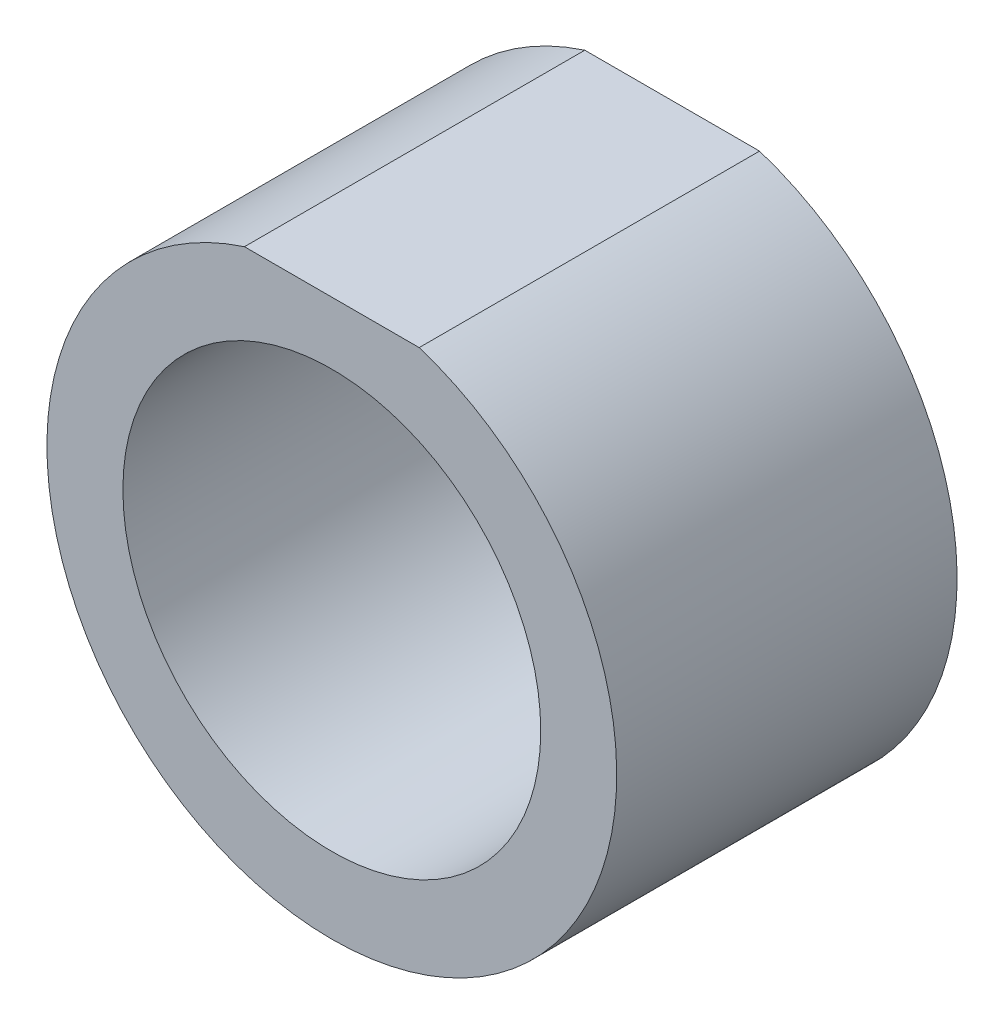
from build123d import *

# Parameters (mm, degrees)
SKETCH1_R          = 9.525
SKETCH1_R_2        = 6.985
EXTRUDE1_DEPTH     = 11.3792
CUT_EXTRUDE1_DEPTH = 18.633418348


with BuildPart() as part:
    # Sketch1 → Extrude1 (new body)
    with BuildSketch(Plane.XY):
        Circle(SKETCH1_R)
        Circle(SKETCH1_R_2, mode=Mode.SUBTRACT)
    extrude(amount=EXTRUDE1_DEPTH)

    # Sketch2 → Cut-Extrude1 (cut, through all)
    with BuildSketch(Plane.XY.offset(11.3792)):
        Polygon((-2.921, 9.066056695), (2.921, 9.066056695), (0, 10.371363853), align=None)
    extrude(amount=-CUT_EXTRUDE1_DEPTH, mode=Mode.SUBTRACT)


solid = part.part
